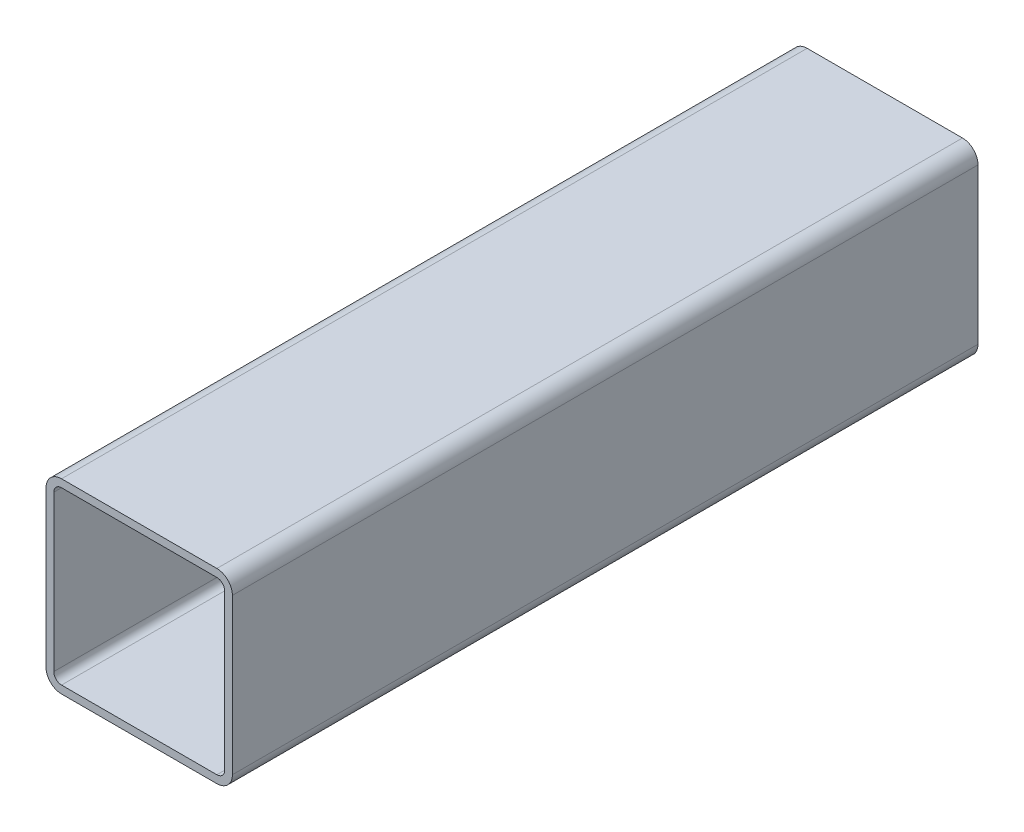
ISO-10303-21;
HEADER;
FILE_DESCRIPTION(('STEP AP214'),'2;1');
FILE_NAME('part.step','',(''),(''),'','','');
FILE_SCHEMA(('AUTOMOTIVE_DESIGN { 1 0 10303 214 1 1 1 1 }'));
ENDSEC;
DATA;
#1=APPLICATION_CONTEXT('core data for automotive mechanical design processes');
#2=APPLICATION_PROTOCOL_DEFINITION('international standard','automotive_design',2000,#1);
#3=PRODUCT_CONTEXT('',#1,'mechanical');
#4=PRODUCT('Part','Part','',(#3));
#5=PRODUCT_RELATED_PRODUCT_CATEGORY('part','',(#4));
#6=PRODUCT_DEFINITION_FORMATION('','',#4);
#7=PRODUCT_DEFINITION_CONTEXT('part definition',#1,'design');
#8=PRODUCT_DEFINITION('design','',#6,#7);
#9=PRODUCT_DEFINITION_SHAPE('','',#8);
#10=(LENGTH_UNIT() NAMED_UNIT(*) SI_UNIT(.MILLI.,.METRE.));
#11=(NAMED_UNIT(*) PLANE_ANGLE_UNIT() SI_UNIT($,.RADIAN.));
#12=(NAMED_UNIT(*) SI_UNIT($,.STERADIAN.) SOLID_ANGLE_UNIT());
#13=UNCERTAINTY_MEASURE_WITH_UNIT(LENGTH_MEASURE(1.E-05),#10,'distance_accuracy_value','');
#14=(GEOMETRIC_REPRESENTATION_CONTEXT(3) GLOBAL_UNCERTAINTY_ASSIGNED_CONTEXT((#13)) GLOBAL_UNIT_ASSIGNED_CONTEXT((#10,
#11,#12)) REPRESENTATION_CONTEXT('',''));
#15=CARTESIAN_POINT('',(0.,0.,0.));
#16=DIRECTION('',(0.,0.,1.));
#17=DIRECTION('',(1.,0.,0.));
#18=AXIS2_PLACEMENT_3D('',#15,#16,#17);
#19=CARTESIAN_POINT('',(8.83911603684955,71.9306737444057,304.8));
#20=DIRECTION('',(0.,0.,1.));
#21=DIRECTION('',(1.,0.,0.));
#22=AXIS2_PLACEMENT_3D('',#19,#20,#21);
#23=PLANE('',#22);
#24=CARTESIAN_POINT('',(8.83911603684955,71.9306737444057,304.8));
#25=DIRECTION('',(0.,0.,1.));
#26=DIRECTION('',(1.,0.,0.));
#27=AXIS2_PLACEMENT_3D('',#24,#25,#26);
#28=CIRCLE('',#27,6.35);
#29=CARTESIAN_POINT('',(8.83911603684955,78.2806737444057,304.8));
#30=VERTEX_POINT('',#29);
#31=CARTESIAN_POINT('',(2.48911603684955,71.9306737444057,304.8));
#32=VERTEX_POINT('',#31);
#33=EDGE_CURVE('E211',#30,#32,#28,.T.);
#34=ORIENTED_EDGE('',*,*,#33,.T.);
#35=DIRECTION('',(0.,-1.,0.));
#36=VECTOR('',#35,1.);
#37=CARTESIAN_POINT('',(2.48911603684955,8.4306737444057,304.8));
#38=LINE('',#37,#36);
#39=CARTESIAN_POINT('',(2.48911603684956,8.4306737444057,304.8));
#40=VERTEX_POINT('',#39);
#41=EDGE_CURVE('E214',#32,#40,#38,.T.);
#42=ORIENTED_EDGE('',*,*,#41,.T.);
#43=CARTESIAN_POINT('',(8.83911603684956,8.4306737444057,304.8));
#44=DIRECTION('',(0.,0.,1.));
#45=DIRECTION('',(1.,0.,0.));
#46=AXIS2_PLACEMENT_3D('',#43,#44,#45);
#47=CIRCLE('',#46,6.35);
#48=CARTESIAN_POINT('',(8.83911603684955,2.0806737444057,304.8));
#49=VERTEX_POINT('',#48);
#50=EDGE_CURVE('E217',#40,#49,#47,.T.);
#51=ORIENTED_EDGE('',*,*,#50,.T.);
#52=DIRECTION('',(1.,0.,0.));
#53=VECTOR('',#52,1.);
#54=CARTESIAN_POINT('',(72.3391160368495,2.0806737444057,304.8));
#55=LINE('',#54,#53);
#56=CARTESIAN_POINT('',(72.3391160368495,2.0806737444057,304.8));
#57=VERTEX_POINT('',#56);
#58=EDGE_CURVE('E219',#49,#57,#55,.T.);
#59=ORIENTED_EDGE('',*,*,#58,.T.);
#60=CARTESIAN_POINT('',(72.3391160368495,8.4306737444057,304.8));
#61=DIRECTION('',(0.,0.,1.));
#62=DIRECTION('',(1.,0.,0.));
#63=AXIS2_PLACEMENT_3D('',#60,#61,#62);
#64=CIRCLE('',#63,6.35);
#65=CARTESIAN_POINT('',(78.6891160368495,8.4306737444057,304.8));
#66=VERTEX_POINT('',#65);
#67=EDGE_CURVE('E221',#57,#66,#64,.T.);
#68=ORIENTED_EDGE('',*,*,#67,.T.);
#69=DIRECTION('',(0.,1.,0.));
#70=VECTOR('',#69,1.);
#71=CARTESIAN_POINT('',(78.6891160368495,71.9306737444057,304.8));
#72=LINE('',#71,#70);
#73=CARTESIAN_POINT('',(78.6891160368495,71.9306737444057,304.8));
#74=VERTEX_POINT('',#73);
#75=EDGE_CURVE('E223',#66,#74,#72,.T.);
#76=ORIENTED_EDGE('',*,*,#75,.T.);
#77=CARTESIAN_POINT('',(72.3391160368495,71.9306737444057,304.8));
#78=DIRECTION('',(0.,0.,1.));
#79=DIRECTION('',(1.,0.,0.));
#80=AXIS2_PLACEMENT_3D('',#77,#78,#79);
#81=CIRCLE('',#80,6.34999999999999);
#82=CARTESIAN_POINT('',(72.3391160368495,78.2806737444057,304.8));
#83=VERTEX_POINT('',#82);
#84=EDGE_CURVE('E225',#74,#83,#81,.T.);
#85=ORIENTED_EDGE('',*,*,#84,.T.);
#86=DIRECTION('',(-1.,0.,0.));
#87=VECTOR('',#86,1.);
#88=CARTESIAN_POINT('',(8.83911603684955,78.2806737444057,304.8));
#89=LINE('',#88,#87);
#90=EDGE_CURVE('E227',#83,#30,#89,.T.);
#91=ORIENTED_EDGE('',*,*,#90,.T.);
#92=EDGE_LOOP('',(#34,#42,#51,#59,#68,#76,#85,#91));
#93=FACE_BOUND('',#92,.T.);
#94=DIRECTION('',(0.,-1.,0.));
#95=VECTOR('',#94,1.);
#96=CARTESIAN_POINT('',(5.66411603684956,8.4306737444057,304.8));
#97=LINE('',#96,#95);
#98=CARTESIAN_POINT('',(5.66411603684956,71.9306737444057,304.8));
#99=VERTEX_POINT('',#98);
#100=CARTESIAN_POINT('',(5.66411603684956,8.4306737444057,304.8));
#101=VERTEX_POINT('',#100);
#102=EDGE_CURVE('E154',#99,#101,#97,.T.);
#103=ORIENTED_EDGE('',*,*,#102,.F.);
#104=CARTESIAN_POINT('',(8.83911603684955,71.9306737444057,304.8));
#105=DIRECTION('',(0.,0.,1.));
#106=DIRECTION('',(1.,0.,0.));
#107=AXIS2_PLACEMENT_3D('',#104,#105,#106);
#108=CIRCLE('',#107,3.175);
#109=CARTESIAN_POINT('',(8.83911603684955,75.1056737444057,304.8));
#110=VERTEX_POINT('',#109);
#111=EDGE_CURVE('E146',#110,#99,#108,.T.);
#112=ORIENTED_EDGE('',*,*,#111,.F.);
#113=DIRECTION('',(-1.,0.,0.));
#114=VECTOR('',#113,1.);
#115=CARTESIAN_POINT('',(8.83911603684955,75.1056737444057,304.8));
#116=LINE('',#115,#114);
#117=CARTESIAN_POINT('',(72.3391160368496,75.1056737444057,304.8));
#118=VERTEX_POINT('',#117);
#119=EDGE_CURVE('E179',#118,#110,#116,.T.);
#120=ORIENTED_EDGE('',*,*,#119,.F.);
#121=CARTESIAN_POINT('',(72.3391160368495,71.9306737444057,304.8));
#122=DIRECTION('',(0.,0.,1.));
#123=DIRECTION('',(1.,0.,0.));
#124=AXIS2_PLACEMENT_3D('',#121,#122,#123);
#125=CIRCLE('',#124,3.175);
#126=CARTESIAN_POINT('',(75.5141160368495,71.9306737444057,304.8));
#127=VERTEX_POINT('',#126);
#128=EDGE_CURVE('E177',#127,#118,#125,.T.);
#129=ORIENTED_EDGE('',*,*,#128,.F.);
#130=DIRECTION('',(0.,1.,0.));
#131=VECTOR('',#130,1.);
#132=CARTESIAN_POINT('',(75.5141160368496,71.9306737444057,304.8));
#133=LINE('',#132,#131);
#134=CARTESIAN_POINT('',(75.5141160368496,8.4306737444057,304.8));
#135=VERTEX_POINT('',#134);
#136=EDGE_CURVE('E175',#135,#127,#133,.T.);
#137=ORIENTED_EDGE('',*,*,#136,.F.);
#138=CARTESIAN_POINT('',(72.3391160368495,8.4306737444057,304.8));
#139=DIRECTION('',(0.,0.,1.));
#140=DIRECTION('',(1.,0.,0.));
#141=AXIS2_PLACEMENT_3D('',#138,#139,#140);
#142=CIRCLE('',#141,3.175);
#143=CARTESIAN_POINT('',(72.3391160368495,5.2556737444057,304.8));
#144=VERTEX_POINT('',#143);
#145=EDGE_CURVE('E173',#144,#135,#142,.T.);
#146=ORIENTED_EDGE('',*,*,#145,.F.);
#147=DIRECTION('',(1.,0.,0.));
#148=VECTOR('',#147,1.);
#149=CARTESIAN_POINT('',(72.3391160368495,5.2556737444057,304.8));
#150=LINE('',#149,#148);
#151=CARTESIAN_POINT('',(8.83911603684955,5.2556737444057,304.8));
#152=VERTEX_POINT('',#151);
#153=EDGE_CURVE('E169',#152,#144,#150,.T.);
#154=ORIENTED_EDGE('',*,*,#153,.F.);
#155=CARTESIAN_POINT('',(8.83911603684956,8.4306737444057,304.8));
#156=DIRECTION('',(0.,0.,1.));
#157=DIRECTION('',(1.,0.,0.));
#158=AXIS2_PLACEMENT_3D('',#155,#156,#157);
#159=CIRCLE('',#158,3.175);
#160=EDGE_CURVE('E167',#101,#152,#159,.T.);
#161=ORIENTED_EDGE('',*,*,#160,.F.);
#162=EDGE_LOOP('',(#103,#112,#120,#129,#137,#146,#154,#161));
#163=FACE_BOUND('',#162,.T.);
#164=ADVANCED_FACE('F33',(#93,#163),#23,.T.);
#165=CARTESIAN_POINT('',(8.83911603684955,71.9306737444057,0.));
#166=DIRECTION('',(0.,0.,1.));
#167=DIRECTION('',(1.,0.,0.));
#168=AXIS2_PLACEMENT_3D('',#165,#166,#167);
#169=PLANE('',#168);
#170=CARTESIAN_POINT('',(8.83911603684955,71.9306737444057,0.));
#171=DIRECTION('',(0.,0.,1.));
#172=DIRECTION('',(1.,0.,0.));
#173=AXIS2_PLACEMENT_3D('',#170,#171,#172);
#174=CIRCLE('',#173,6.35);
#175=CARTESIAN_POINT('',(8.83911603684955,78.2806737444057,0.));
#176=VERTEX_POINT('',#175);
#177=CARTESIAN_POINT('',(2.48911603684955,71.9306737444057,0.));
#178=VERTEX_POINT('',#177);
#179=EDGE_CURVE('E162',#176,#178,#174,.T.);
#180=ORIENTED_EDGE('',*,*,#179,.F.);
#181=DIRECTION('',(-1.,0.,0.));
#182=VECTOR('',#181,1.);
#183=CARTESIAN_POINT('',(8.83911603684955,78.2806737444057,0.));
#184=LINE('',#183,#182);
#185=CARTESIAN_POINT('',(72.3391160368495,78.2806737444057,0.));
#186=VERTEX_POINT('',#185);
#187=EDGE_CURVE('E215',#186,#176,#184,.T.);
#188=ORIENTED_EDGE('',*,*,#187,.F.);
#189=CARTESIAN_POINT('',(72.3391160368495,71.9306737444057,0.));
#190=DIRECTION('',(0.,0.,1.));
#191=DIRECTION('',(1.,0.,0.));
#192=AXIS2_PLACEMENT_3D('',#189,#190,#191);
#193=CIRCLE('',#192,6.34999999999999);
#194=CARTESIAN_POINT('',(78.6891160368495,71.9306737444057,0.));
#195=VERTEX_POINT('',#194);
#196=EDGE_CURVE('E242',#195,#186,#193,.T.);
#197=ORIENTED_EDGE('',*,*,#196,.F.);
#198=DIRECTION('',(0.,1.,0.));
#199=VECTOR('',#198,1.);
#200=CARTESIAN_POINT('',(78.6891160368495,71.9306737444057,0.));
#201=LINE('',#200,#199);
#202=CARTESIAN_POINT('',(78.6891160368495,8.4306737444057,0.));
#203=VERTEX_POINT('',#202);
#204=EDGE_CURVE('E240',#203,#195,#201,.T.);
#205=ORIENTED_EDGE('',*,*,#204,.F.);
#206=CARTESIAN_POINT('',(72.3391160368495,8.4306737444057,0.));
#207=DIRECTION('',(0.,0.,1.));
#208=DIRECTION('',(1.,0.,0.));
#209=AXIS2_PLACEMENT_3D('',#206,#207,#208);
#210=CIRCLE('',#209,6.35);
#211=CARTESIAN_POINT('',(72.3391160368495,2.0806737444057,0.));
#212=VERTEX_POINT('',#211);
#213=EDGE_CURVE('E238',#212,#203,#210,.T.);
#214=ORIENTED_EDGE('',*,*,#213,.F.);
#215=DIRECTION('',(1.,0.,0.));
#216=VECTOR('',#215,1.);
#217=CARTESIAN_POINT('',(72.3391160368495,2.0806737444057,0.));
#218=LINE('',#217,#216);
#219=CARTESIAN_POINT('',(8.83911603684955,2.0806737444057,0.));
#220=VERTEX_POINT('',#219);
#221=EDGE_CURVE('E236',#220,#212,#218,.T.);
#222=ORIENTED_EDGE('',*,*,#221,.F.);
#223=CARTESIAN_POINT('',(8.83911603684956,8.4306737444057,0.));
#224=DIRECTION('',(0.,0.,1.));
#225=DIRECTION('',(1.,0.,0.));
#226=AXIS2_PLACEMENT_3D('',#223,#224,#225);
#227=CIRCLE('',#226,6.35);
#228=CARTESIAN_POINT('',(2.48911603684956,8.4306737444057,0.));
#229=VERTEX_POINT('',#228);
#230=EDGE_CURVE('E234',#229,#220,#227,.T.);
#231=ORIENTED_EDGE('',*,*,#230,.F.);
#232=DIRECTION('',(0.,-1.,0.));
#233=VECTOR('',#232,1.);
#234=CARTESIAN_POINT('',(2.48911603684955,8.4306737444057,0.));
#235=LINE('',#234,#233);
#236=EDGE_CURVE('E232',#178,#229,#235,.T.);
#237=ORIENTED_EDGE('',*,*,#236,.F.);
#238=EDGE_LOOP('',(#180,#188,#197,#205,#214,#222,#231,#237));
#239=FACE_BOUND('',#238,.T.);
#240=CARTESIAN_POINT('',(8.83911603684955,71.9306737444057,0.));
#241=DIRECTION('',(0.,0.,1.));
#242=DIRECTION('',(1.,0.,0.));
#243=AXIS2_PLACEMENT_3D('',#240,#241,#242);
#244=CIRCLE('',#243,3.175);
#245=CARTESIAN_POINT('',(8.83911603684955,75.1056737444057,0.));
#246=VERTEX_POINT('',#245);
#247=CARTESIAN_POINT('',(5.66411603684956,71.9306737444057,0.));
#248=VERTEX_POINT('',#247);
#249=EDGE_CURVE('E56',#246,#248,#244,.T.);
#250=ORIENTED_EDGE('',*,*,#249,.T.);
#251=DIRECTION('',(0.,-1.,0.));
#252=VECTOR('',#251,1.);
#253=CARTESIAN_POINT('',(5.66411603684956,8.4306737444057,0.));
#254=LINE('',#253,#252);
#255=CARTESIAN_POINT('',(5.66411603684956,8.4306737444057,0.));
#256=VERTEX_POINT('',#255);
#257=EDGE_CURVE('E161',#248,#256,#254,.T.);
#258=ORIENTED_EDGE('',*,*,#257,.T.);
#259=CARTESIAN_POINT('',(8.83911603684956,8.4306737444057,0.));
#260=DIRECTION('',(0.,0.,1.));
#261=DIRECTION('',(1.,0.,0.));
#262=AXIS2_PLACEMENT_3D('',#259,#260,#261);
#263=CIRCLE('',#262,3.175);
#264=CARTESIAN_POINT('',(8.83911603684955,5.2556737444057,0.));
#265=VERTEX_POINT('',#264);
#266=EDGE_CURVE('E183',#256,#265,#263,.T.);
#267=ORIENTED_EDGE('',*,*,#266,.T.);
#268=DIRECTION('',(1.,0.,0.));
#269=VECTOR('',#268,1.);
#270=CARTESIAN_POINT('',(72.3391160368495,5.2556737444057,0.));
#271=LINE('',#270,#269);
#272=CARTESIAN_POINT('',(72.3391160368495,5.2556737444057,0.));
#273=VERTEX_POINT('',#272);
#274=EDGE_CURVE('E186',#265,#273,#271,.T.);
#275=ORIENTED_EDGE('',*,*,#274,.T.);
#276=CARTESIAN_POINT('',(72.3391160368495,8.4306737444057,0.));
#277=DIRECTION('',(0.,0.,1.));
#278=DIRECTION('',(1.,0.,0.));
#279=AXIS2_PLACEMENT_3D('',#276,#277,#278);
#280=CIRCLE('',#279,3.175);
#281=CARTESIAN_POINT('',(75.5141160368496,8.4306737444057,0.));
#282=VERTEX_POINT('',#281);
#283=EDGE_CURVE('E189',#273,#282,#280,.T.);
#284=ORIENTED_EDGE('',*,*,#283,.T.);
#285=DIRECTION('',(0.,1.,0.));
#286=VECTOR('',#285,1.);
#287=CARTESIAN_POINT('',(75.5141160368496,71.9306737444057,0.));
#288=LINE('',#287,#286);
#289=CARTESIAN_POINT('',(75.5141160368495,71.9306737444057,0.));
#290=VERTEX_POINT('',#289);
#291=EDGE_CURVE('E192',#282,#290,#288,.T.);
#292=ORIENTED_EDGE('',*,*,#291,.T.);
#293=CARTESIAN_POINT('',(72.3391160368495,71.9306737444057,0.));
#294=DIRECTION('',(0.,0.,1.));
#295=DIRECTION('',(1.,0.,0.));
#296=AXIS2_PLACEMENT_3D('',#293,#294,#295);
#297=CIRCLE('',#296,3.175);
#298=CARTESIAN_POINT('',(72.3391160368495,75.1056737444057,0.));
#299=VERTEX_POINT('',#298);
#300=EDGE_CURVE('E195',#290,#299,#297,.T.);
#301=ORIENTED_EDGE('',*,*,#300,.T.);
#302=DIRECTION('',(-1.,0.,0.));
#303=VECTOR('',#302,1.);
#304=CARTESIAN_POINT('',(8.83911603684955,75.1056737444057,0.));
#305=LINE('',#304,#303);
#306=EDGE_CURVE('E155',#299,#246,#305,.T.);
#307=ORIENTED_EDGE('',*,*,#306,.T.);
#308=EDGE_LOOP('',(#250,#258,#267,#275,#284,#292,#301,#307));
#309=FACE_BOUND('',#308,.T.);
#310=ADVANCED_FACE('F272',(#239,#309),#169,.F.);
#311=CARTESIAN_POINT('',(8.83911603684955,71.9306737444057,304.8));
#312=DIRECTION('',(0.,0.,-1.));
#313=DIRECTION('',(-1.,0.,0.));
#314=AXIS2_PLACEMENT_3D('',#311,#312,#313);
#315=CYLINDRICAL_SURFACE('',#314,6.35);
#316=ORIENTED_EDGE('',*,*,#179,.T.);
#317=DIRECTION('',(0.,0.,-1.));
#318=VECTOR('',#317,1.);
#319=CARTESIAN_POINT('',(2.48911603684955,71.9306737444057,304.8));
#320=LINE('',#319,#318);
#321=EDGE_CURVE('E11',#32,#178,#320,.T.);
#322=ORIENTED_EDGE('',*,*,#321,.F.);
#323=ORIENTED_EDGE('',*,*,#33,.F.);
#324=DIRECTION('',(0.,0.,-1.));
#325=VECTOR('',#324,1.);
#326=CARTESIAN_POINT('',(8.83911603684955,78.2806737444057,304.8));
#327=LINE('',#326,#325);
#328=EDGE_CURVE('E229',#30,#176,#327,.T.);
#329=ORIENTED_EDGE('',*,*,#328,.T.);
#330=EDGE_LOOP('',(#316,#322,#323,#329));
#331=FACE_BOUND('',#330,.T.);
#332=ADVANCED_FACE('F35',(#331),#315,.T.);
#333=CARTESIAN_POINT('',(2.48911603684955,8.4306737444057,304.8));
#334=DIRECTION('',(1.,0.,0.));
#335=DIRECTION('',(0.,0.,-1.));
#336=AXIS2_PLACEMENT_3D('',#333,#334,#335);
#337=PLANE('',#336);
#338=ORIENTED_EDGE('',*,*,#236,.T.);
#339=DIRECTION('',(0.,0.,-1.));
#340=VECTOR('',#339,1.);
#341=CARTESIAN_POINT('',(2.48911603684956,8.4306737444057,304.8));
#342=LINE('',#341,#340);
#343=EDGE_CURVE('E41',#40,#229,#342,.T.);
#344=ORIENTED_EDGE('',*,*,#343,.F.);
#345=ORIENTED_EDGE('',*,*,#41,.F.);
#346=ORIENTED_EDGE('',*,*,#321,.T.);
#347=EDGE_LOOP('',(#338,#344,#345,#346));
#348=FACE_BOUND('',#347,.T.);
#349=ADVANCED_FACE('F289',(#348),#337,.F.);
#350=CARTESIAN_POINT('',(8.83911603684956,8.4306737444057,304.8));
#351=DIRECTION('',(0.,0.,-1.));
#352=DIRECTION('',(-1.,0.,0.));
#353=AXIS2_PLACEMENT_3D('',#350,#351,#352);
#354=CYLINDRICAL_SURFACE('',#353,6.35);
#355=ORIENTED_EDGE('',*,*,#230,.T.);
#356=DIRECTION('',(0.,0.,-1.));
#357=VECTOR('',#356,1.);
#358=CARTESIAN_POINT('',(8.83911603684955,2.0806737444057,304.8));
#359=LINE('',#358,#357);
#360=EDGE_CURVE('E259',#49,#220,#359,.T.);
#361=ORIENTED_EDGE('',*,*,#360,.F.);
#362=ORIENTED_EDGE('',*,*,#50,.F.);
#363=ORIENTED_EDGE('',*,*,#343,.T.);
#364=EDGE_LOOP('',(#355,#361,#362,#363));
#365=FACE_BOUND('',#364,.T.);
#366=ADVANCED_FACE('F266',(#365),#354,.T.);
#367=CARTESIAN_POINT('',(72.3391160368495,2.0806737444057,304.8));
#368=DIRECTION('',(0.,1.,0.));
#369=DIRECTION('',(0.,0.,1.));
#370=AXIS2_PLACEMENT_3D('',#367,#368,#369);
#371=PLANE('',#370);
#372=ORIENTED_EDGE('',*,*,#221,.T.);
#373=DIRECTION('',(0.,0.,-1.));
#374=VECTOR('',#373,1.);
#375=CARTESIAN_POINT('',(72.3391160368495,2.0806737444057,304.8));
#376=LINE('',#375,#374);
#377=EDGE_CURVE('E256',#57,#212,#376,.T.);
#378=ORIENTED_EDGE('',*,*,#377,.F.);
#379=ORIENTED_EDGE('',*,*,#58,.F.);
#380=ORIENTED_EDGE('',*,*,#360,.T.);
#381=EDGE_LOOP('',(#372,#378,#379,#380));
#382=FACE_BOUND('',#381,.T.);
#383=ADVANCED_FACE('F278',(#382),#371,.F.);
#384=CARTESIAN_POINT('',(72.3391160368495,8.4306737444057,304.8));
#385=DIRECTION('',(0.,0.,-1.));
#386=DIRECTION('',(-1.,0.,0.));
#387=AXIS2_PLACEMENT_3D('',#384,#385,#386);
#388=CYLINDRICAL_SURFACE('',#387,6.35);
#389=ORIENTED_EDGE('',*,*,#213,.T.);
#390=DIRECTION('',(0.,0.,-1.));
#391=VECTOR('',#390,1.);
#392=CARTESIAN_POINT('',(78.6891160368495,8.4306737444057,304.8));
#393=LINE('',#392,#391);
#394=EDGE_CURVE('E253',#66,#203,#393,.T.);
#395=ORIENTED_EDGE('',*,*,#394,.F.);
#396=ORIENTED_EDGE('',*,*,#67,.F.);
#397=ORIENTED_EDGE('',*,*,#377,.T.);
#398=EDGE_LOOP('',(#389,#395,#396,#397));
#399=FACE_BOUND('',#398,.T.);
#400=ADVANCED_FACE('F282',(#399),#388,.T.);
#401=CARTESIAN_POINT('',(78.6891160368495,71.9306737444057,304.8));
#402=DIRECTION('',(-1.,0.,0.));
#403=DIRECTION('',(0.,0.,1.));
#404=AXIS2_PLACEMENT_3D('',#401,#402,#403);
#405=PLANE('',#404);
#406=ORIENTED_EDGE('',*,*,#204,.T.);
#407=DIRECTION('',(0.,0.,-1.));
#408=VECTOR('',#407,1.);
#409=CARTESIAN_POINT('',(78.6891160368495,71.9306737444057,304.8));
#410=LINE('',#409,#408);
#411=EDGE_CURVE('E250',#74,#195,#410,.T.);
#412=ORIENTED_EDGE('',*,*,#411,.F.);
#413=ORIENTED_EDGE('',*,*,#75,.F.);
#414=ORIENTED_EDGE('',*,*,#394,.T.);
#415=EDGE_LOOP('',(#406,#412,#413,#414));
#416=FACE_BOUND('',#415,.T.);
#417=ADVANCED_FACE('F302',(#416),#405,.F.);
#418=CARTESIAN_POINT('',(72.3391160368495,71.9306737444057,304.8));
#419=DIRECTION('',(0.,0.,-1.));
#420=DIRECTION('',(-1.,0.,0.));
#421=AXIS2_PLACEMENT_3D('',#418,#419,#420);
#422=CYLINDRICAL_SURFACE('',#421,6.34999999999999);
#423=ORIENTED_EDGE('',*,*,#196,.T.);
#424=DIRECTION('',(0.,0.,-1.));
#425=VECTOR('',#424,1.);
#426=CARTESIAN_POINT('',(72.3391160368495,78.2806737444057,304.8));
#427=LINE('',#426,#425);
#428=EDGE_CURVE('E247',#83,#186,#427,.T.);
#429=ORIENTED_EDGE('',*,*,#428,.F.);
#430=ORIENTED_EDGE('',*,*,#84,.F.);
#431=ORIENTED_EDGE('',*,*,#411,.T.);
#432=EDGE_LOOP('',(#423,#429,#430,#431));
#433=FACE_BOUND('',#432,.T.);
#434=ADVANCED_FACE('F300',(#433),#422,.T.);
#435=CARTESIAN_POINT('',(8.83911603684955,78.2806737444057,304.8));
#436=DIRECTION('',(0.,-1.,0.));
#437=DIRECTION('',(0.,0.,-1.));
#438=AXIS2_PLACEMENT_3D('',#435,#436,#437);
#439=PLANE('',#438);
#440=ORIENTED_EDGE('',*,*,#187,.T.);
#441=ORIENTED_EDGE('',*,*,#328,.F.);
#442=ORIENTED_EDGE('',*,*,#90,.F.);
#443=ORIENTED_EDGE('',*,*,#428,.T.);
#444=EDGE_LOOP('',(#440,#441,#442,#443));
#445=FACE_BOUND('',#444,.T.);
#446=ADVANCED_FACE('F295',(#445),#439,.F.);
#447=CARTESIAN_POINT('',(8.83911603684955,71.9306737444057,304.8));
#448=DIRECTION('',(0.,0.,-1.));
#449=DIRECTION('',(-1.,0.,0.));
#450=AXIS2_PLACEMENT_3D('',#447,#448,#449);
#451=CYLINDRICAL_SURFACE('',#450,3.175);
#452=ORIENTED_EDGE('',*,*,#249,.F.);
#453=DIRECTION('',(0.,0.,-1.));
#454=VECTOR('',#453,1.);
#455=CARTESIAN_POINT('',(8.83911603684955,75.1056737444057,304.8));
#456=LINE('',#455,#454);
#457=EDGE_CURVE('E150',#110,#246,#456,.T.);
#458=ORIENTED_EDGE('',*,*,#457,.F.);
#459=ORIENTED_EDGE('',*,*,#111,.T.);
#460=DIRECTION('',(0.,0.,-1.));
#461=VECTOR('',#460,1.);
#462=CARTESIAN_POINT('',(5.66411603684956,71.9306737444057,304.8));
#463=LINE('',#462,#461);
#464=EDGE_CURVE('E149',#99,#248,#463,.T.);
#465=ORIENTED_EDGE('',*,*,#464,.T.);
#466=EDGE_LOOP('',(#452,#458,#459,#465));
#467=FACE_BOUND('',#466,.T.);
#468=ADVANCED_FACE('F148',(#467),#451,.F.);
#469=CARTESIAN_POINT('',(5.66411603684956,8.4306737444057,304.8));
#470=DIRECTION('',(1.,0.,0.));
#471=DIRECTION('',(0.,0.,-1.));
#472=AXIS2_PLACEMENT_3D('',#469,#470,#471);
#473=PLANE('',#472);
#474=ORIENTED_EDGE('',*,*,#257,.F.);
#475=ORIENTED_EDGE('',*,*,#464,.F.);
#476=ORIENTED_EDGE('',*,*,#102,.T.);
#477=DIRECTION('',(0.,0.,-1.));
#478=VECTOR('',#477,1.);
#479=CARTESIAN_POINT('',(5.66411603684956,8.4306737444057,304.8));
#480=LINE('',#479,#478);
#481=EDGE_CURVE('E163',#101,#256,#480,.T.);
#482=ORIENTED_EDGE('',*,*,#481,.T.);
#483=EDGE_LOOP('',(#474,#475,#476,#482));
#484=FACE_BOUND('',#483,.T.);
#485=ADVANCED_FACE('F158',(#484),#473,.T.);
#486=CARTESIAN_POINT('',(8.83911603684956,8.4306737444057,304.8));
#487=DIRECTION('',(0.,0.,-1.));
#488=DIRECTION('',(-1.,0.,0.));
#489=AXIS2_PLACEMENT_3D('',#486,#487,#488);
#490=CYLINDRICAL_SURFACE('',#489,3.175);
#491=ORIENTED_EDGE('',*,*,#266,.F.);
#492=ORIENTED_EDGE('',*,*,#481,.F.);
#493=ORIENTED_EDGE('',*,*,#160,.T.);
#494=DIRECTION('',(0.,0.,-1.));
#495=VECTOR('',#494,1.);
#496=CARTESIAN_POINT('',(8.83911603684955,5.2556737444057,304.8));
#497=LINE('',#496,#495);
#498=EDGE_CURVE('E208',#152,#265,#497,.T.);
#499=ORIENTED_EDGE('',*,*,#498,.T.);
#500=EDGE_LOOP('',(#491,#492,#493,#499));
#501=FACE_BOUND('',#500,.T.);
#502=ADVANCED_FACE('F327',(#501),#490,.F.);
#503=CARTESIAN_POINT('',(72.3391160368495,5.2556737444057,304.8));
#504=DIRECTION('',(0.,1.,0.));
#505=DIRECTION('',(0.,0.,1.));
#506=AXIS2_PLACEMENT_3D('',#503,#504,#505);
#507=PLANE('',#506);
#508=ORIENTED_EDGE('',*,*,#274,.F.);
#509=ORIENTED_EDGE('',*,*,#498,.F.);
#510=ORIENTED_EDGE('',*,*,#153,.T.);
#511=DIRECTION('',(0.,0.,-1.));
#512=VECTOR('',#511,1.);
#513=CARTESIAN_POINT('',(72.3391160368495,5.2556737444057,304.8));
#514=LINE('',#513,#512);
#515=EDGE_CURVE('E206',#144,#273,#514,.T.);
#516=ORIENTED_EDGE('',*,*,#515,.T.);
#517=EDGE_LOOP('',(#508,#509,#510,#516));
#518=FACE_BOUND('',#517,.T.);
#519=ADVANCED_FACE('F331',(#518),#507,.T.);
#520=CARTESIAN_POINT('',(72.3391160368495,8.4306737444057,304.8));
#521=DIRECTION('',(0.,0.,-1.));
#522=DIRECTION('',(-1.,0.,0.));
#523=AXIS2_PLACEMENT_3D('',#520,#521,#522);
#524=CYLINDRICAL_SURFACE('',#523,3.175);
#525=ORIENTED_EDGE('',*,*,#283,.F.);
#526=ORIENTED_EDGE('',*,*,#515,.F.);
#527=ORIENTED_EDGE('',*,*,#145,.T.);
#528=DIRECTION('',(0.,0.,-1.));
#529=VECTOR('',#528,1.);
#530=CARTESIAN_POINT('',(75.5141160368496,8.4306737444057,304.8));
#531=LINE('',#530,#529);
#532=EDGE_CURVE('E204',#135,#282,#531,.T.);
#533=ORIENTED_EDGE('',*,*,#532,.T.);
#534=EDGE_LOOP('',(#525,#526,#527,#533));
#535=FACE_BOUND('',#534,.T.);
#536=ADVANCED_FACE('F337',(#535),#524,.F.);
#537=CARTESIAN_POINT('',(75.5141160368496,71.9306737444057,304.8));
#538=DIRECTION('',(-1.,0.,0.));
#539=DIRECTION('',(0.,0.,1.));
#540=AXIS2_PLACEMENT_3D('',#537,#538,#539);
#541=PLANE('',#540);
#542=ORIENTED_EDGE('',*,*,#291,.F.);
#543=ORIENTED_EDGE('',*,*,#532,.F.);
#544=ORIENTED_EDGE('',*,*,#136,.T.);
#545=DIRECTION('',(0.,0.,-1.));
#546=VECTOR('',#545,1.);
#547=CARTESIAN_POINT('',(75.5141160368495,71.9306737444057,304.8));
#548=LINE('',#547,#546);
#549=EDGE_CURVE('E202',#127,#290,#548,.T.);
#550=ORIENTED_EDGE('',*,*,#549,.T.);
#551=EDGE_LOOP('',(#542,#543,#544,#550));
#552=FACE_BOUND('',#551,.T.);
#553=ADVANCED_FACE('F341',(#552),#541,.T.);
#554=CARTESIAN_POINT('',(72.3391160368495,71.9306737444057,304.8));
#555=DIRECTION('',(0.,0.,-1.));
#556=DIRECTION('',(-1.,0.,0.));
#557=AXIS2_PLACEMENT_3D('',#554,#555,#556);
#558=CYLINDRICAL_SURFACE('',#557,3.175);
#559=ORIENTED_EDGE('',*,*,#300,.F.);
#560=ORIENTED_EDGE('',*,*,#549,.F.);
#561=ORIENTED_EDGE('',*,*,#128,.T.);
#562=DIRECTION('',(0.,0.,-1.));
#563=VECTOR('',#562,1.);
#564=CARTESIAN_POINT('',(72.3391160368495,75.1056737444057,304.8));
#565=LINE('',#564,#563);
#566=EDGE_CURVE('E48',#118,#299,#565,.T.);
#567=ORIENTED_EDGE('',*,*,#566,.T.);
#568=EDGE_LOOP('',(#559,#560,#561,#567));
#569=FACE_BOUND('',#568,.T.);
#570=ADVANCED_FACE('F345',(#569),#558,.F.);
#571=CARTESIAN_POINT('',(8.83911603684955,75.1056737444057,304.8));
#572=DIRECTION('',(0.,-1.,0.));
#573=DIRECTION('',(0.,0.,-1.));
#574=AXIS2_PLACEMENT_3D('',#571,#572,#573);
#575=PLANE('',#574);
#576=ORIENTED_EDGE('',*,*,#306,.F.);
#577=ORIENTED_EDGE('',*,*,#566,.F.);
#578=ORIENTED_EDGE('',*,*,#119,.T.);
#579=ORIENTED_EDGE('',*,*,#457,.T.);
#580=EDGE_LOOP('',(#576,#577,#578,#579));
#581=FACE_BOUND('',#580,.T.);
#582=ADVANCED_FACE('F349',(#581),#575,.T.);
#583=CLOSED_SHELL('',(#164,#310,#332,#349,#366,#383,#400,#417,#434,#446,#468,#485,#502,#519,
#536,#553,#570,#582));
#584=MANIFOLD_SOLID_BREP('B2',#583);
#585=ADVANCED_BREP_SHAPE_REPRESENTATION('',(#18,#584),#14);
#586=SHAPE_DEFINITION_REPRESENTATION(#9,#585);
ENDSEC;
END-ISO-10303-21;
